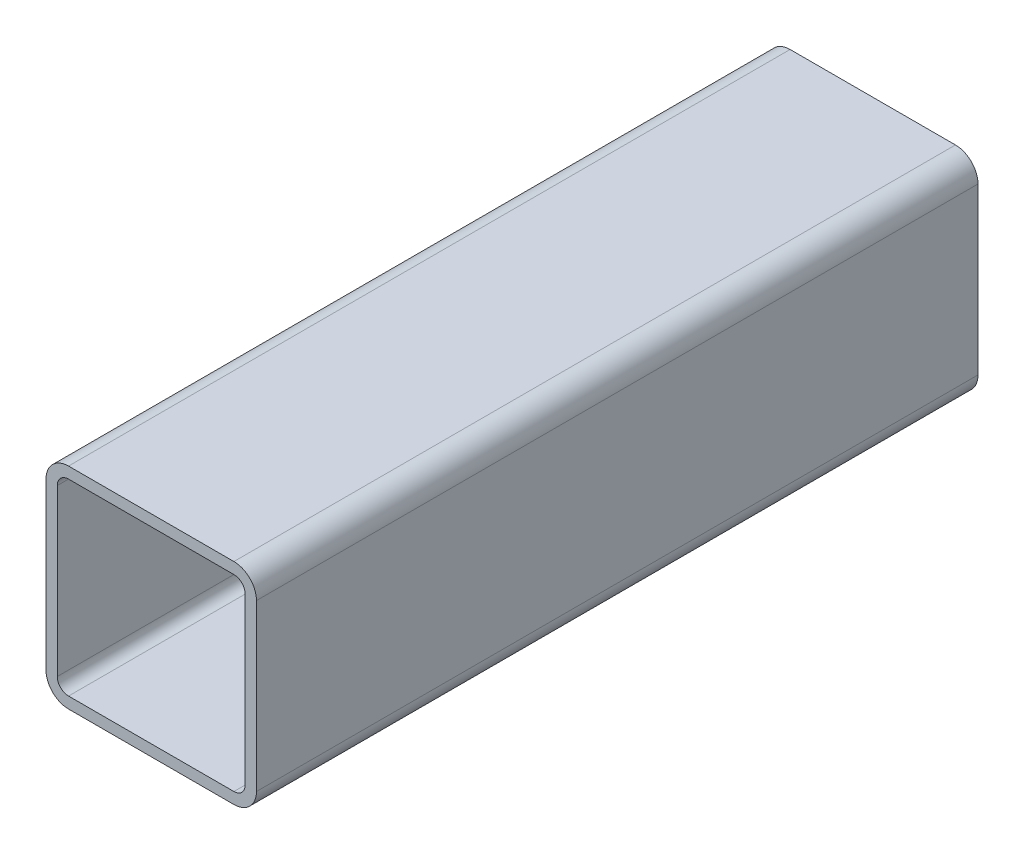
ISO-10303-21;
HEADER;
FILE_DESCRIPTION(('STEP AP214'),'2;1');
FILE_NAME('part.step','',(''),(''),'','','');
FILE_SCHEMA(('AUTOMOTIVE_DESIGN { 1 0 10303 214 1 1 1 1 }'));
ENDSEC;
DATA;
#1=APPLICATION_CONTEXT('core data for automotive mechanical design processes');
#2=APPLICATION_PROTOCOL_DEFINITION('international standard','automotive_design',2000,#1);
#3=PRODUCT_CONTEXT('',#1,'mechanical');
#4=PRODUCT('Part','Part','',(#3));
#5=PRODUCT_RELATED_PRODUCT_CATEGORY('part','',(#4));
#6=PRODUCT_DEFINITION_FORMATION('','',#4);
#7=PRODUCT_DEFINITION_CONTEXT('part definition',#1,'design');
#8=PRODUCT_DEFINITION('design','',#6,#7);
#9=PRODUCT_DEFINITION_SHAPE('','',#8);
#10=(LENGTH_UNIT() NAMED_UNIT(*) SI_UNIT(.MILLI.,.METRE.));
#11=(NAMED_UNIT(*) PLANE_ANGLE_UNIT() SI_UNIT($,.RADIAN.));
#12=(NAMED_UNIT(*) SI_UNIT($,.STERADIAN.) SOLID_ANGLE_UNIT());
#13=UNCERTAINTY_MEASURE_WITH_UNIT(LENGTH_MEASURE(1.E-05),#10,'distance_accuracy_value','');
#14=(GEOMETRIC_REPRESENTATION_CONTEXT(3) GLOBAL_UNCERTAINTY_ASSIGNED_CONTEXT((#13)) GLOBAL_UNIT_ASSIGNED_CONTEXT((#10,
#11,#12)) REPRESENTATION_CONTEXT('',''));
#15=CARTESIAN_POINT('',(0.,0.,0.));
#16=DIRECTION('',(0.,0.,1.));
#17=DIRECTION('',(1.,0.,0.));
#18=AXIS2_PLACEMENT_3D('',#15,#16,#17);
#19=CARTESIAN_POINT('',(11.6071469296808,80.1765103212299,304.8));
#20=DIRECTION('',(0.,0.,1.));
#21=DIRECTION('',(1.,0.,0.));
#22=AXIS2_PLACEMENT_3D('',#19,#20,#21);
#23=PLANE('',#22);
#24=CARTESIAN_POINT('',(11.6071469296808,80.1765103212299,304.8));
#25=DIRECTION('',(0.,0.,1.));
#26=DIRECTION('',(1.,0.,0.));
#27=AXIS2_PLACEMENT_3D('',#24,#25,#26);
#28=CIRCLE('',#27,9.525);
#29=CARTESIAN_POINT('',(11.6071469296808,89.7015103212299,304.8));
#30=VERTEX_POINT('',#29);
#31=CARTESIAN_POINT('',(2.08214692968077,80.1765103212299,304.8));
#32=VERTEX_POINT('',#31);
#33=EDGE_CURVE('E211',#30,#32,#28,.T.);
#34=ORIENTED_EDGE('',*,*,#33,.T.);
#35=DIRECTION('',(0.,-1.,0.));
#36=VECTOR('',#35,1.);
#37=CARTESIAN_POINT('',(2.08214692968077,10.3265103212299,304.8));
#38=LINE('',#37,#36);
#39=CARTESIAN_POINT('',(2.08214692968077,10.3265103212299,304.8));
#40=VERTEX_POINT('',#39);
#41=EDGE_CURVE('E214',#32,#40,#38,.T.);
#42=ORIENTED_EDGE('',*,*,#41,.T.);
#43=CARTESIAN_POINT('',(11.6071469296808,10.3265103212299,304.8));
#44=DIRECTION('',(0.,0.,1.));
#45=DIRECTION('',(1.,0.,0.));
#46=AXIS2_PLACEMENT_3D('',#43,#44,#45);
#47=CIRCLE('',#46,9.525);
#48=CARTESIAN_POINT('',(11.6071469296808,0.801510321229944,304.8));
#49=VERTEX_POINT('',#48);
#50=EDGE_CURVE('E217',#40,#49,#47,.T.);
#51=ORIENTED_EDGE('',*,*,#50,.T.);
#52=DIRECTION('',(1.,0.,0.));
#53=VECTOR('',#52,1.);
#54=CARTESIAN_POINT('',(81.4571469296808,0.801510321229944,304.8));
#55=LINE('',#54,#53);
#56=CARTESIAN_POINT('',(81.4571469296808,0.801510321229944,304.8));
#57=VERTEX_POINT('',#56);
#58=EDGE_CURVE('E219',#49,#57,#55,.T.);
#59=ORIENTED_EDGE('',*,*,#58,.T.);
#60=CARTESIAN_POINT('',(81.4571469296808,10.32651032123,304.8));
#61=DIRECTION('',(0.,0.,1.));
#62=DIRECTION('',(1.,0.,0.));
#63=AXIS2_PLACEMENT_3D('',#60,#61,#62);
#64=CIRCLE('',#63,9.52500000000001);
#65=CARTESIAN_POINT('',(90.9821469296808,10.3265103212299,304.8));
#66=VERTEX_POINT('',#65);
#67=EDGE_CURVE('E221',#57,#66,#64,.T.);
#68=ORIENTED_EDGE('',*,*,#67,.T.);
#69=DIRECTION('',(0.,1.,0.));
#70=VECTOR('',#69,1.);
#71=CARTESIAN_POINT('',(90.9821469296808,80.1765103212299,304.8));
#72=LINE('',#71,#70);
#73=CARTESIAN_POINT('',(90.9821469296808,80.1765103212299,304.8));
#74=VERTEX_POINT('',#73);
#75=EDGE_CURVE('E223',#66,#74,#72,.T.);
#76=ORIENTED_EDGE('',*,*,#75,.T.);
#77=CARTESIAN_POINT('',(81.4571469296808,80.1765103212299,304.8));
#78=DIRECTION('',(0.,0.,1.));
#79=DIRECTION('',(1.,0.,0.));
#80=AXIS2_PLACEMENT_3D('',#77,#78,#79);
#81=CIRCLE('',#80,9.52500000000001);
#82=CARTESIAN_POINT('',(81.4571469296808,89.7015103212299,304.8));
#83=VERTEX_POINT('',#82);
#84=EDGE_CURVE('E225',#74,#83,#81,.T.);
#85=ORIENTED_EDGE('',*,*,#84,.T.);
#86=DIRECTION('',(-1.,0.,0.));
#87=VECTOR('',#86,1.);
#88=CARTESIAN_POINT('',(11.6071469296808,89.7015103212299,304.8));
#89=LINE('',#88,#87);
#90=EDGE_CURVE('E227',#83,#30,#89,.T.);
#91=ORIENTED_EDGE('',*,*,#90,.T.);
#92=EDGE_LOOP('',(#34,#42,#51,#59,#68,#76,#85,#91));
#93=FACE_BOUND('',#92,.T.);
#94=DIRECTION('',(0.,-1.,0.));
#95=VECTOR('',#94,1.);
#96=CARTESIAN_POINT('',(6.84464692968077,10.3265103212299,304.8));
#97=LINE('',#96,#95);
#98=CARTESIAN_POINT('',(6.84464692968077,80.1765103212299,304.8));
#99=VERTEX_POINT('',#98);
#100=CARTESIAN_POINT('',(6.84464692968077,10.3265103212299,304.8));
#101=VERTEX_POINT('',#100);
#102=EDGE_CURVE('E154',#99,#101,#97,.T.);
#103=ORIENTED_EDGE('',*,*,#102,.F.);
#104=CARTESIAN_POINT('',(11.6071469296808,80.1765103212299,304.8));
#105=DIRECTION('',(0.,0.,1.));
#106=DIRECTION('',(1.,0.,0.));
#107=AXIS2_PLACEMENT_3D('',#104,#105,#106);
#108=CIRCLE('',#107,4.76250000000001);
#109=CARTESIAN_POINT('',(11.6071469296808,84.9390103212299,304.8));
#110=VERTEX_POINT('',#109);
#111=EDGE_CURVE('E146',#110,#99,#108,.T.);
#112=ORIENTED_EDGE('',*,*,#111,.F.);
#113=DIRECTION('',(-1.,0.,0.));
#114=VECTOR('',#113,1.);
#115=CARTESIAN_POINT('',(11.6071469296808,84.9390103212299,304.8));
#116=LINE('',#115,#114);
#117=CARTESIAN_POINT('',(81.4571469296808,84.9390103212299,304.8));
#118=VERTEX_POINT('',#117);
#119=EDGE_CURVE('E179',#118,#110,#116,.T.);
#120=ORIENTED_EDGE('',*,*,#119,.F.);
#121=CARTESIAN_POINT('',(81.4571469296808,80.1765103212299,304.8));
#122=DIRECTION('',(0.,0.,1.));
#123=DIRECTION('',(1.,0.,0.));
#124=AXIS2_PLACEMENT_3D('',#121,#122,#123);
#125=CIRCLE('',#124,4.76250000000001);
#126=CARTESIAN_POINT('',(86.2196469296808,80.1765103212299,304.8));
#127=VERTEX_POINT('',#126);
#128=EDGE_CURVE('E177',#127,#118,#125,.T.);
#129=ORIENTED_EDGE('',*,*,#128,.F.);
#130=DIRECTION('',(0.,1.,0.));
#131=VECTOR('',#130,1.);
#132=CARTESIAN_POINT('',(86.2196469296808,80.1765103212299,304.8));
#133=LINE('',#132,#131);
#134=CARTESIAN_POINT('',(86.2196469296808,10.3265103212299,304.8));
#135=VERTEX_POINT('',#134);
#136=EDGE_CURVE('E175',#135,#127,#133,.T.);
#137=ORIENTED_EDGE('',*,*,#136,.F.);
#138=CARTESIAN_POINT('',(81.4571469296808,10.32651032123,304.8));
#139=DIRECTION('',(0.,0.,1.));
#140=DIRECTION('',(1.,0.,0.));
#141=AXIS2_PLACEMENT_3D('',#138,#139,#140);
#142=CIRCLE('',#141,4.7625);
#143=CARTESIAN_POINT('',(81.4571469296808,5.56401032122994,304.8));
#144=VERTEX_POINT('',#143);
#145=EDGE_CURVE('E173',#144,#135,#142,.T.);
#146=ORIENTED_EDGE('',*,*,#145,.F.);
#147=DIRECTION('',(1.,0.,0.));
#148=VECTOR('',#147,1.);
#149=CARTESIAN_POINT('',(81.4571469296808,5.56401032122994,304.8));
#150=LINE('',#149,#148);
#151=CARTESIAN_POINT('',(11.6071469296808,5.56401032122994,304.8));
#152=VERTEX_POINT('',#151);
#153=EDGE_CURVE('E169',#152,#144,#150,.T.);
#154=ORIENTED_EDGE('',*,*,#153,.F.);
#155=CARTESIAN_POINT('',(11.6071469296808,10.3265103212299,304.8));
#156=DIRECTION('',(0.,0.,1.));
#157=DIRECTION('',(1.,0.,0.));
#158=AXIS2_PLACEMENT_3D('',#155,#156,#157);
#159=CIRCLE('',#158,4.7625);
#160=EDGE_CURVE('E167',#101,#152,#159,.T.);
#161=ORIENTED_EDGE('',*,*,#160,.F.);
#162=EDGE_LOOP('',(#103,#112,#120,#129,#137,#146,#154,#161));
#163=FACE_BOUND('',#162,.T.);
#164=ADVANCED_FACE('F33',(#93,#163),#23,.T.);
#165=CARTESIAN_POINT('',(11.6071469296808,80.1765103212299,0.));
#166=DIRECTION('',(0.,0.,1.));
#167=DIRECTION('',(1.,0.,0.));
#168=AXIS2_PLACEMENT_3D('',#165,#166,#167);
#169=PLANE('',#168);
#170=CARTESIAN_POINT('',(11.6071469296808,80.1765103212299,0.));
#171=DIRECTION('',(0.,0.,1.));
#172=DIRECTION('',(1.,0.,0.));
#173=AXIS2_PLACEMENT_3D('',#170,#171,#172);
#174=CIRCLE('',#173,9.525);
#175=CARTESIAN_POINT('',(11.6071469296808,89.7015103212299,0.));
#176=VERTEX_POINT('',#175);
#177=CARTESIAN_POINT('',(2.08214692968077,80.1765103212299,0.));
#178=VERTEX_POINT('',#177);
#179=EDGE_CURVE('E162',#176,#178,#174,.T.);
#180=ORIENTED_EDGE('',*,*,#179,.F.);
#181=DIRECTION('',(-1.,0.,0.));
#182=VECTOR('',#181,1.);
#183=CARTESIAN_POINT('',(11.6071469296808,89.7015103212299,0.));
#184=LINE('',#183,#182);
#185=CARTESIAN_POINT('',(81.4571469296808,89.7015103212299,0.));
#186=VERTEX_POINT('',#185);
#187=EDGE_CURVE('E215',#186,#176,#184,.T.);
#188=ORIENTED_EDGE('',*,*,#187,.F.);
#189=CARTESIAN_POINT('',(81.4571469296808,80.1765103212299,0.));
#190=DIRECTION('',(0.,0.,1.));
#191=DIRECTION('',(1.,0.,0.));
#192=AXIS2_PLACEMENT_3D('',#189,#190,#191);
#193=CIRCLE('',#192,9.52500000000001);
#194=CARTESIAN_POINT('',(90.9821469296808,80.1765103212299,0.));
#195=VERTEX_POINT('',#194);
#196=EDGE_CURVE('E242',#195,#186,#193,.T.);
#197=ORIENTED_EDGE('',*,*,#196,.F.);
#198=DIRECTION('',(0.,1.,0.));
#199=VECTOR('',#198,1.);
#200=CARTESIAN_POINT('',(90.9821469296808,80.1765103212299,0.));
#201=LINE('',#200,#199);
#202=CARTESIAN_POINT('',(90.9821469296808,10.3265103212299,0.));
#203=VERTEX_POINT('',#202);
#204=EDGE_CURVE('E240',#203,#195,#201,.T.);
#205=ORIENTED_EDGE('',*,*,#204,.F.);
#206=CARTESIAN_POINT('',(81.4571469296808,10.32651032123,0.));
#207=DIRECTION('',(0.,0.,1.));
#208=DIRECTION('',(1.,0.,0.));
#209=AXIS2_PLACEMENT_3D('',#206,#207,#208);
#210=CIRCLE('',#209,9.52500000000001);
#211=CARTESIAN_POINT('',(81.4571469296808,0.801510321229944,0.));
#212=VERTEX_POINT('',#211);
#213=EDGE_CURVE('E238',#212,#203,#210,.T.);
#214=ORIENTED_EDGE('',*,*,#213,.F.);
#215=DIRECTION('',(1.,0.,0.));
#216=VECTOR('',#215,1.);
#217=CARTESIAN_POINT('',(81.4571469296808,0.801510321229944,0.));
#218=LINE('',#217,#216);
#219=CARTESIAN_POINT('',(11.6071469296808,0.801510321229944,0.));
#220=VERTEX_POINT('',#219);
#221=EDGE_CURVE('E236',#220,#212,#218,.T.);
#222=ORIENTED_EDGE('',*,*,#221,.F.);
#223=CARTESIAN_POINT('',(11.6071469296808,10.3265103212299,0.));
#224=DIRECTION('',(0.,0.,1.));
#225=DIRECTION('',(1.,0.,0.));
#226=AXIS2_PLACEMENT_3D('',#223,#224,#225);
#227=CIRCLE('',#226,9.525);
#228=CARTESIAN_POINT('',(2.08214692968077,10.3265103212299,0.));
#229=VERTEX_POINT('',#228);
#230=EDGE_CURVE('E234',#229,#220,#227,.T.);
#231=ORIENTED_EDGE('',*,*,#230,.F.);
#232=DIRECTION('',(0.,-1.,0.));
#233=VECTOR('',#232,1.);
#234=CARTESIAN_POINT('',(2.08214692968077,10.3265103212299,0.));
#235=LINE('',#234,#233);
#236=EDGE_CURVE('E232',#178,#229,#235,.T.);
#237=ORIENTED_EDGE('',*,*,#236,.F.);
#238=EDGE_LOOP('',(#180,#188,#197,#205,#214,#222,#231,#237));
#239=FACE_BOUND('',#238,.T.);
#240=CARTESIAN_POINT('',(11.6071469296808,80.1765103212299,0.));
#241=DIRECTION('',(0.,0.,1.));
#242=DIRECTION('',(1.,0.,0.));
#243=AXIS2_PLACEMENT_3D('',#240,#241,#242);
#244=CIRCLE('',#243,4.76250000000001);
#245=CARTESIAN_POINT('',(11.6071469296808,84.9390103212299,0.));
#246=VERTEX_POINT('',#245);
#247=CARTESIAN_POINT('',(6.84464692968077,80.1765103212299,0.));
#248=VERTEX_POINT('',#247);
#249=EDGE_CURVE('E56',#246,#248,#244,.T.);
#250=ORIENTED_EDGE('',*,*,#249,.T.);
#251=DIRECTION('',(0.,-1.,0.));
#252=VECTOR('',#251,1.);
#253=CARTESIAN_POINT('',(6.84464692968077,10.3265103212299,0.));
#254=LINE('',#253,#252);
#255=CARTESIAN_POINT('',(6.84464692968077,10.3265103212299,0.));
#256=VERTEX_POINT('',#255);
#257=EDGE_CURVE('E161',#248,#256,#254,.T.);
#258=ORIENTED_EDGE('',*,*,#257,.T.);
#259=CARTESIAN_POINT('',(11.6071469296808,10.3265103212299,0.));
#260=DIRECTION('',(0.,0.,1.));
#261=DIRECTION('',(1.,0.,0.));
#262=AXIS2_PLACEMENT_3D('',#259,#260,#261);
#263=CIRCLE('',#262,4.7625);
#264=CARTESIAN_POINT('',(11.6071469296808,5.56401032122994,0.));
#265=VERTEX_POINT('',#264);
#266=EDGE_CURVE('E183',#256,#265,#263,.T.);
#267=ORIENTED_EDGE('',*,*,#266,.T.);
#268=DIRECTION('',(1.,0.,0.));
#269=VECTOR('',#268,1.);
#270=CARTESIAN_POINT('',(81.4571469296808,5.56401032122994,0.));
#271=LINE('',#270,#269);
#272=CARTESIAN_POINT('',(81.4571469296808,5.56401032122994,0.));
#273=VERTEX_POINT('',#272);
#274=EDGE_CURVE('E186',#265,#273,#271,.T.);
#275=ORIENTED_EDGE('',*,*,#274,.T.);
#276=CARTESIAN_POINT('',(81.4571469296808,10.32651032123,0.));
#277=DIRECTION('',(0.,0.,1.));
#278=DIRECTION('',(1.,0.,0.));
#279=AXIS2_PLACEMENT_3D('',#276,#277,#278);
#280=CIRCLE('',#279,4.7625);
#281=CARTESIAN_POINT('',(86.2196469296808,10.3265103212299,0.));
#282=VERTEX_POINT('',#281);
#283=EDGE_CURVE('E189',#273,#282,#280,.T.);
#284=ORIENTED_EDGE('',*,*,#283,.T.);
#285=DIRECTION('',(0.,1.,0.));
#286=VECTOR('',#285,1.);
#287=CARTESIAN_POINT('',(86.2196469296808,80.1765103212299,0.));
#288=LINE('',#287,#286);
#289=CARTESIAN_POINT('',(86.2196469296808,80.1765103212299,0.));
#290=VERTEX_POINT('',#289);
#291=EDGE_CURVE('E192',#282,#290,#288,.T.);
#292=ORIENTED_EDGE('',*,*,#291,.T.);
#293=CARTESIAN_POINT('',(81.4571469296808,80.1765103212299,0.));
#294=DIRECTION('',(0.,0.,1.));
#295=DIRECTION('',(1.,0.,0.));
#296=AXIS2_PLACEMENT_3D('',#293,#294,#295);
#297=CIRCLE('',#296,4.76250000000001);
#298=CARTESIAN_POINT('',(81.4571469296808,84.9390103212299,0.));
#299=VERTEX_POINT('',#298);
#300=EDGE_CURVE('E195',#290,#299,#297,.T.);
#301=ORIENTED_EDGE('',*,*,#300,.T.);
#302=DIRECTION('',(-1.,0.,0.));
#303=VECTOR('',#302,1.);
#304=CARTESIAN_POINT('',(11.6071469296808,84.9390103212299,0.));
#305=LINE('',#304,#303);
#306=EDGE_CURVE('E155',#299,#246,#305,.T.);
#307=ORIENTED_EDGE('',*,*,#306,.T.);
#308=EDGE_LOOP('',(#250,#258,#267,#275,#284,#292,#301,#307));
#309=FACE_BOUND('',#308,.T.);
#310=ADVANCED_FACE('F272',(#239,#309),#169,.F.);
#311=CARTESIAN_POINT('',(11.6071469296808,80.1765103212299,304.8));
#312=DIRECTION('',(0.,0.,-1.));
#313=DIRECTION('',(-1.,0.,0.));
#314=AXIS2_PLACEMENT_3D('',#311,#312,#313);
#315=CYLINDRICAL_SURFACE('',#314,9.525);
#316=ORIENTED_EDGE('',*,*,#179,.T.);
#317=DIRECTION('',(0.,0.,-1.));
#318=VECTOR('',#317,1.);
#319=CARTESIAN_POINT('',(2.08214692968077,80.1765103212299,304.8));
#320=LINE('',#319,#318);
#321=EDGE_CURVE('E11',#32,#178,#320,.T.);
#322=ORIENTED_EDGE('',*,*,#321,.F.);
#323=ORIENTED_EDGE('',*,*,#33,.F.);
#324=DIRECTION('',(0.,0.,-1.));
#325=VECTOR('',#324,1.);
#326=CARTESIAN_POINT('',(11.6071469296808,89.7015103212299,304.8));
#327=LINE('',#326,#325);
#328=EDGE_CURVE('E229',#30,#176,#327,.T.);
#329=ORIENTED_EDGE('',*,*,#328,.T.);
#330=EDGE_LOOP('',(#316,#322,#323,#329));
#331=FACE_BOUND('',#330,.T.);
#332=ADVANCED_FACE('F35',(#331),#315,.T.);
#333=CARTESIAN_POINT('',(2.08214692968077,10.3265103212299,304.8));
#334=DIRECTION('',(1.,0.,0.));
#335=DIRECTION('',(0.,0.,-1.));
#336=AXIS2_PLACEMENT_3D('',#333,#334,#335);
#337=PLANE('',#336);
#338=ORIENTED_EDGE('',*,*,#236,.T.);
#339=DIRECTION('',(0.,0.,-1.));
#340=VECTOR('',#339,1.);
#341=CARTESIAN_POINT('',(2.08214692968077,10.3265103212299,304.8));
#342=LINE('',#341,#340);
#343=EDGE_CURVE('E41',#40,#229,#342,.T.);
#344=ORIENTED_EDGE('',*,*,#343,.F.);
#345=ORIENTED_EDGE('',*,*,#41,.F.);
#346=ORIENTED_EDGE('',*,*,#321,.T.);
#347=EDGE_LOOP('',(#338,#344,#345,#346));
#348=FACE_BOUND('',#347,.T.);
#349=ADVANCED_FACE('F289',(#348),#337,.F.);
#350=CARTESIAN_POINT('',(11.6071469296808,10.3265103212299,304.8));
#351=DIRECTION('',(0.,0.,-1.));
#352=DIRECTION('',(-1.,0.,0.));
#353=AXIS2_PLACEMENT_3D('',#350,#351,#352);
#354=CYLINDRICAL_SURFACE('',#353,9.525);
#355=ORIENTED_EDGE('',*,*,#230,.T.);
#356=DIRECTION('',(0.,0.,-1.));
#357=VECTOR('',#356,1.);
#358=CARTESIAN_POINT('',(11.6071469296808,0.801510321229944,304.8));
#359=LINE('',#358,#357);
#360=EDGE_CURVE('E259',#49,#220,#359,.T.);
#361=ORIENTED_EDGE('',*,*,#360,.F.);
#362=ORIENTED_EDGE('',*,*,#50,.F.);
#363=ORIENTED_EDGE('',*,*,#343,.T.);
#364=EDGE_LOOP('',(#355,#361,#362,#363));
#365=FACE_BOUND('',#364,.T.);
#366=ADVANCED_FACE('F266',(#365),#354,.T.);
#367=CARTESIAN_POINT('',(81.4571469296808,0.801510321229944,304.8));
#368=DIRECTION('',(0.,1.,0.));
#369=DIRECTION('',(0.,0.,1.));
#370=AXIS2_PLACEMENT_3D('',#367,#368,#369);
#371=PLANE('',#370);
#372=ORIENTED_EDGE('',*,*,#221,.T.);
#373=DIRECTION('',(0.,0.,-1.));
#374=VECTOR('',#373,1.);
#375=CARTESIAN_POINT('',(81.4571469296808,0.801510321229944,304.8));
#376=LINE('',#375,#374);
#377=EDGE_CURVE('E256',#57,#212,#376,.T.);
#378=ORIENTED_EDGE('',*,*,#377,.F.);
#379=ORIENTED_EDGE('',*,*,#58,.F.);
#380=ORIENTED_EDGE('',*,*,#360,.T.);
#381=EDGE_LOOP('',(#372,#378,#379,#380));
#382=FACE_BOUND('',#381,.T.);
#383=ADVANCED_FACE('F278',(#382),#371,.F.);
#384=CARTESIAN_POINT('',(81.4571469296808,10.32651032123,304.8));
#385=DIRECTION('',(0.,0.,-1.));
#386=DIRECTION('',(-1.,0.,0.));
#387=AXIS2_PLACEMENT_3D('',#384,#385,#386);
#388=CYLINDRICAL_SURFACE('',#387,9.52500000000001);
#389=ORIENTED_EDGE('',*,*,#213,.T.);
#390=DIRECTION('',(0.,0.,-1.));
#391=VECTOR('',#390,1.);
#392=CARTESIAN_POINT('',(90.9821469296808,10.3265103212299,304.8));
#393=LINE('',#392,#391);
#394=EDGE_CURVE('E253',#66,#203,#393,.T.);
#395=ORIENTED_EDGE('',*,*,#394,.F.);
#396=ORIENTED_EDGE('',*,*,#67,.F.);
#397=ORIENTED_EDGE('',*,*,#377,.T.);
#398=EDGE_LOOP('',(#389,#395,#396,#397));
#399=FACE_BOUND('',#398,.T.);
#400=ADVANCED_FACE('F282',(#399),#388,.T.);
#401=CARTESIAN_POINT('',(90.9821469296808,80.1765103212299,304.8));
#402=DIRECTION('',(-1.,0.,0.));
#403=DIRECTION('',(0.,0.,1.));
#404=AXIS2_PLACEMENT_3D('',#401,#402,#403);
#405=PLANE('',#404);
#406=ORIENTED_EDGE('',*,*,#204,.T.);
#407=DIRECTION('',(0.,0.,-1.));
#408=VECTOR('',#407,1.);
#409=CARTESIAN_POINT('',(90.9821469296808,80.1765103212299,304.8));
#410=LINE('',#409,#408);
#411=EDGE_CURVE('E250',#74,#195,#410,.T.);
#412=ORIENTED_EDGE('',*,*,#411,.F.);
#413=ORIENTED_EDGE('',*,*,#75,.F.);
#414=ORIENTED_EDGE('',*,*,#394,.T.);
#415=EDGE_LOOP('',(#406,#412,#413,#414));
#416=FACE_BOUND('',#415,.T.);
#417=ADVANCED_FACE('F302',(#416),#405,.F.);
#418=CARTESIAN_POINT('',(81.4571469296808,80.1765103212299,304.8));
#419=DIRECTION('',(0.,0.,-1.));
#420=DIRECTION('',(-1.,0.,0.));
#421=AXIS2_PLACEMENT_3D('',#418,#419,#420);
#422=CYLINDRICAL_SURFACE('',#421,9.52500000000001);
#423=ORIENTED_EDGE('',*,*,#196,.T.);
#424=DIRECTION('',(0.,0.,-1.));
#425=VECTOR('',#424,1.);
#426=CARTESIAN_POINT('',(81.4571469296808,89.7015103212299,304.8));
#427=LINE('',#426,#425);
#428=EDGE_CURVE('E247',#83,#186,#427,.T.);
#429=ORIENTED_EDGE('',*,*,#428,.F.);
#430=ORIENTED_EDGE('',*,*,#84,.F.);
#431=ORIENTED_EDGE('',*,*,#411,.T.);
#432=EDGE_LOOP('',(#423,#429,#430,#431));
#433=FACE_BOUND('',#432,.T.);
#434=ADVANCED_FACE('F300',(#433),#422,.T.);
#435=CARTESIAN_POINT('',(11.6071469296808,89.7015103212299,304.8));
#436=DIRECTION('',(0.,-1.,0.));
#437=DIRECTION('',(0.,0.,-1.));
#438=AXIS2_PLACEMENT_3D('',#435,#436,#437);
#439=PLANE('',#438);
#440=ORIENTED_EDGE('',*,*,#187,.T.);
#441=ORIENTED_EDGE('',*,*,#328,.F.);
#442=ORIENTED_EDGE('',*,*,#90,.F.);
#443=ORIENTED_EDGE('',*,*,#428,.T.);
#444=EDGE_LOOP('',(#440,#441,#442,#443));
#445=FACE_BOUND('',#444,.T.);
#446=ADVANCED_FACE('F295',(#445),#439,.F.);
#447=CARTESIAN_POINT('',(11.6071469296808,80.1765103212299,304.8));
#448=DIRECTION('',(0.,0.,-1.));
#449=DIRECTION('',(-1.,0.,0.));
#450=AXIS2_PLACEMENT_3D('',#447,#448,#449);
#451=CYLINDRICAL_SURFACE('',#450,4.76250000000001);
#452=ORIENTED_EDGE('',*,*,#249,.F.);
#453=DIRECTION('',(0.,0.,-1.));
#454=VECTOR('',#453,1.);
#455=CARTESIAN_POINT('',(11.6071469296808,84.9390103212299,304.8));
#456=LINE('',#455,#454);
#457=EDGE_CURVE('E150',#110,#246,#456,.T.);
#458=ORIENTED_EDGE('',*,*,#457,.F.);
#459=ORIENTED_EDGE('',*,*,#111,.T.);
#460=DIRECTION('',(0.,0.,-1.));
#461=VECTOR('',#460,1.);
#462=CARTESIAN_POINT('',(6.84464692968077,80.1765103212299,304.8));
#463=LINE('',#462,#461);
#464=EDGE_CURVE('E149',#99,#248,#463,.T.);
#465=ORIENTED_EDGE('',*,*,#464,.T.);
#466=EDGE_LOOP('',(#452,#458,#459,#465));
#467=FACE_BOUND('',#466,.T.);
#468=ADVANCED_FACE('F148',(#467),#451,.F.);
#469=CARTESIAN_POINT('',(6.84464692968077,10.3265103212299,304.8));
#470=DIRECTION('',(1.,0.,0.));
#471=DIRECTION('',(0.,0.,-1.));
#472=AXIS2_PLACEMENT_3D('',#469,#470,#471);
#473=PLANE('',#472);
#474=ORIENTED_EDGE('',*,*,#257,.F.);
#475=ORIENTED_EDGE('',*,*,#464,.F.);
#476=ORIENTED_EDGE('',*,*,#102,.T.);
#477=DIRECTION('',(0.,0.,-1.));
#478=VECTOR('',#477,1.);
#479=CARTESIAN_POINT('',(6.84464692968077,10.3265103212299,304.8));
#480=LINE('',#479,#478);
#481=EDGE_CURVE('E163',#101,#256,#480,.T.);
#482=ORIENTED_EDGE('',*,*,#481,.T.);
#483=EDGE_LOOP('',(#474,#475,#476,#482));
#484=FACE_BOUND('',#483,.T.);
#485=ADVANCED_FACE('F158',(#484),#473,.T.);
#486=CARTESIAN_POINT('',(11.6071469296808,10.3265103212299,304.8));
#487=DIRECTION('',(0.,0.,-1.));
#488=DIRECTION('',(-1.,0.,0.));
#489=AXIS2_PLACEMENT_3D('',#486,#487,#488);
#490=CYLINDRICAL_SURFACE('',#489,4.7625);
#491=ORIENTED_EDGE('',*,*,#266,.F.);
#492=ORIENTED_EDGE('',*,*,#481,.F.);
#493=ORIENTED_EDGE('',*,*,#160,.T.);
#494=DIRECTION('',(0.,0.,-1.));
#495=VECTOR('',#494,1.);
#496=CARTESIAN_POINT('',(11.6071469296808,5.56401032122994,304.8));
#497=LINE('',#496,#495);
#498=EDGE_CURVE('E208',#152,#265,#497,.T.);
#499=ORIENTED_EDGE('',*,*,#498,.T.);
#500=EDGE_LOOP('',(#491,#492,#493,#499));
#501=FACE_BOUND('',#500,.T.);
#502=ADVANCED_FACE('F327',(#501),#490,.F.);
#503=CARTESIAN_POINT('',(81.4571469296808,5.56401032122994,304.8));
#504=DIRECTION('',(0.,1.,0.));
#505=DIRECTION('',(0.,0.,1.));
#506=AXIS2_PLACEMENT_3D('',#503,#504,#505);
#507=PLANE('',#506);
#508=ORIENTED_EDGE('',*,*,#274,.F.);
#509=ORIENTED_EDGE('',*,*,#498,.F.);
#510=ORIENTED_EDGE('',*,*,#153,.T.);
#511=DIRECTION('',(0.,0.,-1.));
#512=VECTOR('',#511,1.);
#513=CARTESIAN_POINT('',(81.4571469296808,5.56401032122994,304.8));
#514=LINE('',#513,#512);
#515=EDGE_CURVE('E206',#144,#273,#514,.T.);
#516=ORIENTED_EDGE('',*,*,#515,.T.);
#517=EDGE_LOOP('',(#508,#509,#510,#516));
#518=FACE_BOUND('',#517,.T.);
#519=ADVANCED_FACE('F331',(#518),#507,.T.);
#520=CARTESIAN_POINT('',(81.4571469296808,10.32651032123,304.8));
#521=DIRECTION('',(0.,0.,-1.));
#522=DIRECTION('',(-1.,0.,0.));
#523=AXIS2_PLACEMENT_3D('',#520,#521,#522);
#524=CYLINDRICAL_SURFACE('',#523,4.7625);
#525=ORIENTED_EDGE('',*,*,#283,.F.);
#526=ORIENTED_EDGE('',*,*,#515,.F.);
#527=ORIENTED_EDGE('',*,*,#145,.T.);
#528=DIRECTION('',(0.,0.,-1.));
#529=VECTOR('',#528,1.);
#530=CARTESIAN_POINT('',(86.2196469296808,10.3265103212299,304.8));
#531=LINE('',#530,#529);
#532=EDGE_CURVE('E204',#135,#282,#531,.T.);
#533=ORIENTED_EDGE('',*,*,#532,.T.);
#534=EDGE_LOOP('',(#525,#526,#527,#533));
#535=FACE_BOUND('',#534,.T.);
#536=ADVANCED_FACE('F337',(#535),#524,.F.);
#537=CARTESIAN_POINT('',(86.2196469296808,80.1765103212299,304.8));
#538=DIRECTION('',(-1.,0.,0.));
#539=DIRECTION('',(0.,0.,1.));
#540=AXIS2_PLACEMENT_3D('',#537,#538,#539);
#541=PLANE('',#540);
#542=ORIENTED_EDGE('',*,*,#291,.F.);
#543=ORIENTED_EDGE('',*,*,#532,.F.);
#544=ORIENTED_EDGE('',*,*,#136,.T.);
#545=DIRECTION('',(0.,0.,-1.));
#546=VECTOR('',#545,1.);
#547=CARTESIAN_POINT('',(86.2196469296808,80.1765103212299,304.8));
#548=LINE('',#547,#546);
#549=EDGE_CURVE('E202',#127,#290,#548,.T.);
#550=ORIENTED_EDGE('',*,*,#549,.T.);
#551=EDGE_LOOP('',(#542,#543,#544,#550));
#552=FACE_BOUND('',#551,.T.);
#553=ADVANCED_FACE('F341',(#552),#541,.T.);
#554=CARTESIAN_POINT('',(81.4571469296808,80.1765103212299,304.8));
#555=DIRECTION('',(0.,0.,-1.));
#556=DIRECTION('',(-1.,0.,0.));
#557=AXIS2_PLACEMENT_3D('',#554,#555,#556);
#558=CYLINDRICAL_SURFACE('',#557,4.76250000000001);
#559=ORIENTED_EDGE('',*,*,#300,.F.);
#560=ORIENTED_EDGE('',*,*,#549,.F.);
#561=ORIENTED_EDGE('',*,*,#128,.T.);
#562=DIRECTION('',(0.,0.,-1.));
#563=VECTOR('',#562,1.);
#564=CARTESIAN_POINT('',(81.4571469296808,84.9390103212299,304.8));
#565=LINE('',#564,#563);
#566=EDGE_CURVE('E48',#118,#299,#565,.T.);
#567=ORIENTED_EDGE('',*,*,#566,.T.);
#568=EDGE_LOOP('',(#559,#560,#561,#567));
#569=FACE_BOUND('',#568,.T.);
#570=ADVANCED_FACE('F345',(#569),#558,.F.);
#571=CARTESIAN_POINT('',(11.6071469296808,84.9390103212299,304.8));
#572=DIRECTION('',(0.,-1.,0.));
#573=DIRECTION('',(0.,0.,-1.));
#574=AXIS2_PLACEMENT_3D('',#571,#572,#573);
#575=PLANE('',#574);
#576=ORIENTED_EDGE('',*,*,#306,.F.);
#577=ORIENTED_EDGE('',*,*,#566,.F.);
#578=ORIENTED_EDGE('',*,*,#119,.T.);
#579=ORIENTED_EDGE('',*,*,#457,.T.);
#580=EDGE_LOOP('',(#576,#577,#578,#579));
#581=FACE_BOUND('',#580,.T.);
#582=ADVANCED_FACE('F349',(#581),#575,.T.);
#583=CLOSED_SHELL('',(#164,#310,#332,#349,#366,#383,#400,#417,#434,#446,#468,#485,#502,#519,
#536,#553,#570,#582));
#584=MANIFOLD_SOLID_BREP('B2',#583);
#585=ADVANCED_BREP_SHAPE_REPRESENTATION('',(#18,#584),#14);
#586=SHAPE_DEFINITION_REPRESENTATION(#9,#585);
ENDSEC;
END-ISO-10303-21;
